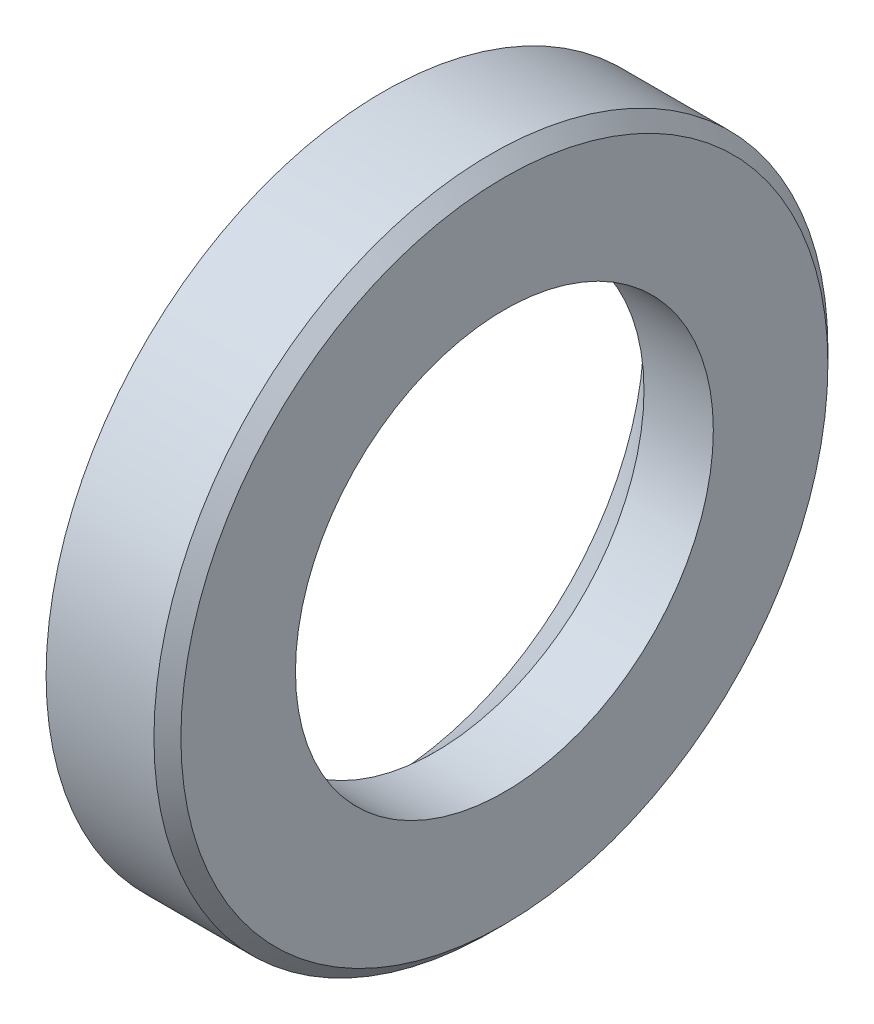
from build123d import *

# Parameters (mm, degrees)
CHANFREIN1_SIZE = 0.2


with BuildPart() as part:
    # Esquisse1 → Base-R_volution (revolve)
    with BuildSketch(Plane.XY, mode=Mode.PRIVATE) as base_r_volution_sk:
        Polygon((2.3, 0.85), (2.3, 2.75), (0.5, 2.75), (0.5, 1.621320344), (1.271320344, 0.85), align=None)
    revolve(base_r_volution_sk.sketch.rotate(Axis((2.746980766, -2.25, 0), (-1, 0, 0)), 90), axis=Axis((2.746980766, -2.25, 0), (-1, 0, 0)))

    # Chanfrein1
    chanfrein1_edges = [part.edges().sort_by_distance(p)[0] for p in [
        (2.3, -2.25, 5),
    ]]
    chamfer(chanfrein1_edges, length=CHANFREIN1_SIZE)


solid = part.part
